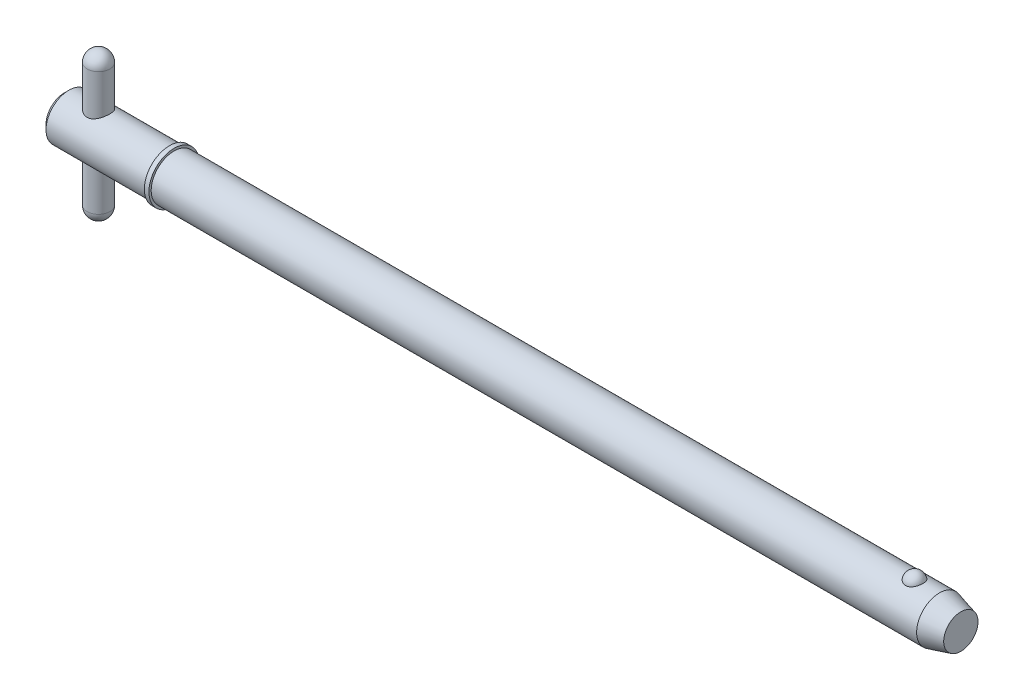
ISO-10303-21;
HEADER;
FILE_DESCRIPTION(('STEP AP214'),'2;1');
FILE_NAME('part.step','',(''),(''),'','','');
FILE_SCHEMA(('AUTOMOTIVE_DESIGN { 1 0 10303 214 1 1 1 1 }'));
ENDSEC;
DATA;
#1=APPLICATION_CONTEXT('core data for automotive mechanical design processes');
#2=APPLICATION_PROTOCOL_DEFINITION('international standard','automotive_design',2000,#1);
#3=PRODUCT_CONTEXT('',#1,'mechanical');
#4=PRODUCT('Part','Part','',(#3));
#5=PRODUCT_RELATED_PRODUCT_CATEGORY('part','',(#4));
#6=PRODUCT_DEFINITION_FORMATION('','',#4);
#7=PRODUCT_DEFINITION_CONTEXT('part definition',#1,'design');
#8=PRODUCT_DEFINITION('design','',#6,#7);
#9=PRODUCT_DEFINITION_SHAPE('','',#8);
#10=(LENGTH_UNIT() NAMED_UNIT(*) SI_UNIT(.MILLI.,.METRE.));
#11=(NAMED_UNIT(*) PLANE_ANGLE_UNIT() SI_UNIT($,.RADIAN.));
#12=(NAMED_UNIT(*) SI_UNIT($,.STERADIAN.) SOLID_ANGLE_UNIT());
#13=UNCERTAINTY_MEASURE_WITH_UNIT(LENGTH_MEASURE(1.E-05),#10,'distance_accuracy_value','');
#14=(GEOMETRIC_REPRESENTATION_CONTEXT(3) GLOBAL_UNCERTAINTY_ASSIGNED_CONTEXT((#13)) GLOBAL_UNIT_ASSIGNED_CONTEXT((#10,
#11,#12)) REPRESENTATION_CONTEXT('',''));
#15=CARTESIAN_POINT('',(0.,0.,0.));
#16=DIRECTION('',(0.,0.,1.));
#17=DIRECTION('',(1.,0.,0.));
#18=AXIS2_PLACEMENT_3D('',#15,#16,#17);
#19=CARTESIAN_POINT('',(5.94,12.7,0.));
#20=DIRECTION('',(0.,-1.,0.));
#21=DIRECTION('',(0.,0.,-1.));
#22=AXIS2_PLACEMENT_3D('',#19,#20,#21);
#23=CYLINDRICAL_SURFACE('',#22,1.98);
#24=CARTESIAN_POINT('',(5.94,-10.72,0.));
#25=DIRECTION('',(0.,-1.,0.));
#26=DIRECTION('',(0.,0.,-1.));
#27=AXIS2_PLACEMENT_3D('',#24,#25,#26);
#28=CIRCLE('',#27,1.98);
#29=CARTESIAN_POINT('',(5.94,-10.72,-1.98));
#30=VERTEX_POINT('',#29);
#31=EDGE_CURVE('P0_E10',#30,#30,#28,.F.);
#32=ORIENTED_EDGE('',*,*,#31,.T.);
#33=EDGE_LOOP('',(#32));
#34=FACE_BOUND('',#33,.T.);
#35=CARTESIAN_POINT('',(5.94,10.72,0.));
#36=DIRECTION('',(0.,-1.,0.));
#37=DIRECTION('',(0.,0.,-1.));
#38=AXIS2_PLACEMENT_3D('',#35,#36,#37);
#39=CIRCLE('',#38,1.98);
#40=CARTESIAN_POINT('',(5.94,10.72,-1.98));
#41=VERTEX_POINT('',#40);
#42=EDGE_CURVE('P0_E21',#41,#41,#39,.T.);
#43=ORIENTED_EDGE('',*,*,#42,.T.);
#44=EDGE_LOOP('',(#43));
#45=FACE_BOUND('',#44,.T.);
#46=ADVANCED_FACE('P0_F14',(#34,#45),#23,.T.);
#47=CARTESIAN_POINT('',(5.94,-10.72,0.));
#48=DIRECTION('',(0.,0.,1.));
#49=DIRECTION('',(1.,0.,0.));
#50=AXIS2_PLACEMENT_3D('',#47,#48,#49);
#51=SPHERICAL_SURFACE('',#50,1.98);
#52=CARTESIAN_POINT('',(5.94,-10.72,0.));
#53=DIRECTION('',(0.,-1.,0.));
#54=DIRECTION('',(0.,0.,-1.));
#55=AXIS2_PLACEMENT_3D('',#52,#53,#54);
#56=SPHERICAL_SURFACE('',#55,1.98);
#57=ORIENTED_EDGE('',*,*,#31,.F.);
#58=EDGE_LOOP('',(#57));
#59=FACE_BOUND('',#58,.T.);
#60=ADVANCED_FACE('P0_F29',(#59),#56,.T.);
#61=CARTESIAN_POINT('',(5.94,10.72,0.));
#62=DIRECTION('',(0.,0.,1.));
#63=DIRECTION('',(1.,0.,0.));
#64=AXIS2_PLACEMENT_3D('',#61,#62,#63);
#65=SPHERICAL_SURFACE('',#64,1.98);
#66=CARTESIAN_POINT('',(5.94,10.72,0.));
#67=DIRECTION('',(0.,-1.,0.));
#68=DIRECTION('',(0.,0.,-1.));
#69=AXIS2_PLACEMENT_3D('',#66,#67,#68);
#70=SPHERICAL_SURFACE('',#69,1.98);
#71=ORIENTED_EDGE('',*,*,#42,.F.);
#72=EDGE_LOOP('',(#71));
#73=FACE_BOUND('',#72,.T.);
#74=ADVANCED_FACE('P0_F16',(#73),#70,.T.);
#75=CLOSED_SHELL('',(#46,#60,#74));
#76=MANIFOLD_SOLID_BREP('P0_B1',#75);
#77=CARTESIAN_POINT('',(0.,0.,0.));
#78=DIRECTION('',(1.,0.,0.));
#79=DIRECTION('',(0.,0.,-1.));
#80=AXIS2_PLACEMENT_3D('',#77,#78,#79);
#81=CYLINDRICAL_SURFACE('',#80,3.97);
#82=CARTESIAN_POINT('',(151.875939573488,0.,0.));
#83=DIRECTION('',(1.,0.,0.));
#84=DIRECTION('',(0.,0.,-1.));
#85=AXIS2_PLACEMENT_3D('',#82,#83,#84);
#86=CIRCLE('',#85,3.97);
#87=CARTESIAN_POINT('',(151.875939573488,0.,-3.97));
#88=VERTEX_POINT('',#87);
#89=EDGE_CURVE('P1_E81',#88,#88,#86,.T.);
#90=ORIENTED_EDGE('',*,*,#89,.F.);
#91=EDGE_LOOP('',(#90));
#92=FACE_BOUND('',#91,.T.);
#93=CARTESIAN_POINT('',(19.05,0.,0.));
#94=DIRECTION('',(1.,0.,0.));
#95=DIRECTION('',(0.,0.,-1.));
#96=AXIS2_PLACEMENT_3D('',#93,#94,#95);
#97=CIRCLE('',#96,3.97);
#98=CARTESIAN_POINT('',(19.05,0.,-3.97));
#99=VERTEX_POINT('',#98);
#100=EDGE_CURVE('P1_E85',#99,#99,#97,.T.);
#101=ORIENTED_EDGE('',*,*,#100,.T.);
#102=EDGE_LOOP('',(#101));
#103=FACE_BOUND('',#102,.T.);
#104=CARTESIAN_POINT('',(147.545192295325,3.65715365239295,1.54470941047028));
#105=CARTESIAN_POINT('',(147.465244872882,3.65716001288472,1.54470290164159));
#106=CARTESIAN_POINT('',(147.385165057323,3.65987074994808,1.53832549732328));
#107=CARTESIAN_POINT('',(147.227237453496,3.67042218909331,1.51297018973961));
#108=CARTESIAN_POINT('',(147.14939614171,3.67827646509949,1.49395894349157));
#109=CARTESIAN_POINT('',(146.998461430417,3.69818848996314,1.44395950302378));
#110=CARTESIAN_POINT('',(146.925356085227,3.71023513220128,1.41300293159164));
#111=CARTESIAN_POINT('',(146.785563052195,3.73721833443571,1.34000212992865));
#112=CARTESIAN_POINT('',(146.718872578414,3.75215363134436,1.2979627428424));
#113=CARTESIAN_POINT('',(146.59148864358,3.78384968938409,1.20248834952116));
#114=CARTESIAN_POINT('',(146.531029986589,3.80065129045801,1.14875388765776));
#115=CARTESIAN_POINT('',(146.419694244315,3.83398532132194,1.03205417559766));
#116=CARTESIAN_POINT('',(146.368820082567,3.85051766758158,0.96908611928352));
#117=CARTESIAN_POINT('',(146.275632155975,3.88238608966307,0.832526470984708));
#118=CARTESIAN_POINT('',(146.233796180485,3.89763698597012,0.758588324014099));
#119=CARTESIAN_POINT('',(146.162510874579,3.92451063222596,0.604352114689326));
#120=CARTESIAN_POINT('',(146.133062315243,3.93613315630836,0.52405365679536));
#121=CARTESIAN_POINT('',(146.086892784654,3.95467606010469,0.358403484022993));
#122=CARTESIAN_POINT('',(146.070312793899,3.96154426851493,0.273006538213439));
#123=CARTESIAN_POINT('',(146.050756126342,3.96967008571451,0.100408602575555));
#124=CARTESIAN_POINT('',(146.047778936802,3.97092790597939,0.0132076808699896));
#125=CARTESIAN_POINT('',(146.055458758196,3.96771794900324,-0.159844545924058));
#126=CARTESIAN_POINT('',(146.066016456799,3.96329187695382,-0.245701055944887));
#127=CARTESIAN_POINT('',(146.10038009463,3.94923163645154,-0.414277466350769));
#128=CARTESIAN_POINT('',(146.124186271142,3.93959737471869,-0.496997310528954));
#129=CARTESIAN_POINT('',(146.18461142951,3.91607752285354,-0.65711357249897));
#130=CARTESIAN_POINT('',(146.221249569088,3.90218558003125,-0.734501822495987));
#131=CARTESIAN_POINT('',(146.306593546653,3.87158287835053,-0.881704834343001));
#132=CARTESIAN_POINT('',(146.355300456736,3.85487186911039,-0.951518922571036));
#133=CARTESIAN_POINT('',(146.464116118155,3.82028735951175,-1.08208159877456));
#134=CARTESIAN_POINT('',(146.524295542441,3.80240713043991,-1.14276958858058));
#135=CARTESIAN_POINT('',(146.654493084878,3.76758161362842,-1.25282437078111));
#136=CARTESIAN_POINT('',(146.724510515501,3.75063626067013,-1.30219195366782));
#137=CARTESIAN_POINT('',(146.87118160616,3.71998948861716,-1.38729709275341));
#138=CARTESIAN_POINT('',(146.947681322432,3.70623183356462,-1.42327904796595));
#139=CARTESIAN_POINT('',(147.106298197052,3.68323188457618,-1.48178996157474));
#140=CARTESIAN_POINT('',(147.1884132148,3.67398788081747,-1.50432401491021));
#141=CARTESIAN_POINT('',(147.351481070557,3.6615216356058,-1.53440939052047));
#142=CARTESIAN_POINT('',(147.432284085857,3.65801951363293,-1.54265826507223));
#143=CARTESIAN_POINT('',(147.59420850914,3.65657341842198,-1.54608423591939));
#144=CARTESIAN_POINT('',(147.675329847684,3.65862829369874,-1.54126404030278));
#145=CARTESIAN_POINT('',(147.832812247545,3.66788969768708,-1.51908474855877));
#146=CARTESIAN_POINT('',(147.909242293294,3.67492621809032,-1.50213925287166));
#147=CARTESIAN_POINT('',(148.058041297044,3.6931840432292,-1.45666982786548));
#148=CARTESIAN_POINT('',(148.130409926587,3.70440568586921,-1.42814496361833));
#149=CARTESIAN_POINT('',(148.270802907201,3.73012749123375,-1.3595631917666));
#150=CARTESIAN_POINT('',(148.338700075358,3.74469307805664,-1.31927107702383));
#151=CARTESIAN_POINT('',(148.466864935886,3.77545272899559,-1.22847440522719));
#152=CARTESIAN_POINT('',(148.527130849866,3.79164717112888,-1.17796747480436));
#153=CARTESIAN_POINT('',(148.641634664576,3.82490325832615,-1.06519260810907));
#154=CARTESIAN_POINT('',(148.695413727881,3.84196735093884,-1.00245914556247));
#155=CARTESIAN_POINT('',(148.792098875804,3.87439863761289,-0.868715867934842));
#156=CARTESIAN_POINT('',(148.835003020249,3.88976552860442,-0.797704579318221));
#157=CARTESIAN_POINT('',(148.910266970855,3.91771381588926,-0.646896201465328));
#158=CARTESIAN_POINT('',(148.94225322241,3.93019255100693,-0.566893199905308));
#159=CARTESIAN_POINT('',(148.993110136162,3.95043886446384,-0.402255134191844));
#160=CARTESIAN_POINT('',(149.011980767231,3.95820643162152,-0.317620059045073));
#161=CARTESIAN_POINT('',(149.03621625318,3.96823733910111,-0.14615699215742));
#162=CARTESIAN_POINT('',(149.041587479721,3.970503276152,-0.0593300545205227));
#163=CARTESIAN_POINT('',(149.038730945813,3.96930811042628,0.11405797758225));
#164=CARTESIAN_POINT('',(149.030503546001,3.9658471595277,0.200619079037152));
#165=CARTESIAN_POINT('',(149.000706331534,3.95358562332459,0.37050665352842));
#166=CARTESIAN_POINT('',(148.97921294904,3.94481563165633,0.453848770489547));
#167=CARTESIAN_POINT('',(148.92338397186,3.92284586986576,0.615497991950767));
#168=CARTESIAN_POINT('',(148.889047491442,3.90964579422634,0.693804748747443));
#169=CARTESIAN_POINT('',(148.807970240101,3.88006987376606,0.843703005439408));
#170=CARTESIAN_POINT('',(148.761153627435,3.86367478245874,0.915249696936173));
#171=CARTESIAN_POINT('',(148.656189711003,3.82949741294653,1.04910810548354));
#172=CARTESIAN_POINT('',(148.598042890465,3.81171519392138,1.11142021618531));
#173=CARTESIAN_POINT('',(148.471743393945,3.7767336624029,1.22503948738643));
#174=CARTESIAN_POINT('',(148.403597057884,3.75953398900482,1.27635357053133));
#175=CARTESIAN_POINT('',(148.258900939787,3.72770506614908,1.36653336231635));
#176=CARTESIAN_POINT('',(148.182348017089,3.7130767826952,1.4053943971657));
#177=CARTESIAN_POINT('',(148.025759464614,3.68864287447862,1.46830480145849));
#178=CARTESIAN_POINT('',(147.945930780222,3.67869017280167,1.49281289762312));
#179=CARTESIAN_POINT('',(147.782987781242,3.66414535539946,1.52817474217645));
#180=CARTESIAN_POINT('',(147.699884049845,3.65953723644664,1.53906926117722));
#181=CARTESIAN_POINT('',(147.592776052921,3.6573894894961,1.54414878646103));
#182=CARTESIAN_POINT('',(147.568990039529,3.65715175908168,1.54471134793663));
#183=CARTESIAN_POINT('',(147.545192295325,3.65715365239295,1.54470941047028));
#184=B_SPLINE_CURVE_WITH_KNOTS('',3,(#104,#105,#106,#107,#108,#109,#110,#111,#112,#113,#114,
#115,#116,#117,#118,#119,#120,#121,#122,#123,#124,#125,#126,#127,#128,#129,#130,#131,#132,#133,
#134,#135,#136,#137,#138,#139,#140,#141,#142,#143,#144,#145,#146,#147,#148,#149,#150,#151,#152,
#153,#154,#155,#156,#157,#158,#159,#160,#161,#162,#163,#164,#165,#166,#167,#168,#169,#170,#171,
#172,#173,#174,#175,#176,#177,#178,#179,#180,#181,#182,#183),.UNSPECIFIED.,.T.,.F.,(4,2,2,2,2,2,
2,2,2,2,2,2,2,2,2,2,2,2,2,2,2,2,2,2,2,2,2,2,2,2,2,2,2,2,2,2,2,2,2,4),(0.,0.239777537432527,
0.48019041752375,0.719971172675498,0.959647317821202,1.20639040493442,1.45320863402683,
1.71093679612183,1.96868099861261,2.22921052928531,2.48973023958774,2.74834928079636,
3.00697295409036,3.26598440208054,3.52501886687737,3.78570385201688,4.04637062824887,
4.30201257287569,4.55755760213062,4.80022994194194,5.04285200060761,5.27757006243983,
5.5123070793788,5.75210128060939,5.99195126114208,6.24392810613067,6.49594987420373,
6.75588818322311,7.01582710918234,7.2756433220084,7.53545264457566,7.79377886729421,
8.05212290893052,8.31207418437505,8.57201437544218,8.83179046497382,9.09166393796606,
9.34270057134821,9.59298357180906,9.66435753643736),.UNSPECIFIED.);
#185=CARTESIAN_POINT('',(147.545192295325,3.65715365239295,1.54470941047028));
#186=VERTEX_POINT('',#185);
#187=EDGE_CURVE('P1_E35',#186,#186,#184,.T.);
#188=ORIENTED_EDGE('',*,*,#187,.T.);
#189=EDGE_LOOP('',(#188));
#190=FACE_BOUND('',#189,.T.);
#191=ADVANCED_FACE('P1_F13',(#92,#103,#190),#81,.T.);
#192=CARTESIAN_POINT('',(0.,0.,0.));
#193=DIRECTION('',(-1.,0.,0.));
#194=DIRECTION('',(0.,0.,1.));
#195=AXIS2_PLACEMENT_3D('',#192,#193,#194);
#196=PLANE('',#195);
#197=CARTESIAN_POINT('',(0.,0.,0.));
#198=DIRECTION('',(1.,0.,0.));
#199=DIRECTION('',(0.,0.,-1.));
#200=AXIS2_PLACEMENT_3D('',#197,#198,#199);
#201=CIRCLE('',#200,3.176);
#202=CARTESIAN_POINT('',(0.,0.,-3.176));
#203=VERTEX_POINT('',#202);
#204=EDGE_CURVE('P1_E9',#203,#203,#201,.T.);
#205=ORIENTED_EDGE('',*,*,#204,.F.);
#206=EDGE_LOOP('',(#205));
#207=FACE_BOUND('',#206,.T.);
#208=ADVANCED_FACE('P1_F15',(#207),#196,.T.);
#209=CARTESIAN_POINT('',(0.793999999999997,0.,0.));
#210=DIRECTION('',(1.,0.,0.));
#211=DIRECTION('',(0.,0.,-1.));
#212=AXIS2_PLACEMENT_3D('',#209,#210,#211);
#213=CONICAL_SURFACE('',#212,3.97,0.78539816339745);
#214=ORIENTED_EDGE('',*,*,#204,.T.);
#215=EDGE_LOOP('',(#214));
#216=FACE_BOUND('',#215,.T.);
#217=CARTESIAN_POINT('',(0.793999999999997,0.,0.));
#218=DIRECTION('',(1.,0.,0.));
#219=DIRECTION('',(0.,0.,-1.));
#220=AXIS2_PLACEMENT_3D('',#217,#218,#219);
#221=CIRCLE('',#220,3.97);
#222=CARTESIAN_POINT('',(0.793999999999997,0.,-3.97));
#223=VERTEX_POINT('',#222);
#224=EDGE_CURVE('P1_E26',#223,#223,#221,.T.);
#225=ORIENTED_EDGE('',*,*,#224,.F.);
#226=EDGE_LOOP('',(#225));
#227=FACE_BOUND('',#226,.T.);
#228=ADVANCED_FACE('P1_F77',(#216,#227),#213,.T.);
#229=CARTESIAN_POINT('',(0.,0.,0.));
#230=DIRECTION('',(1.,0.,0.));
#231=DIRECTION('',(0.,0.,-1.));
#232=AXIS2_PLACEMENT_3D('',#229,#230,#231);
#233=CYLINDRICAL_SURFACE('',#232,3.97);
#234=CARTESIAN_POINT('',(5.94,-3.44100276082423,1.98));
#235=CARTESIAN_POINT('',(5.8367885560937,-3.44101282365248,1.97999171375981));
#236=CARTESIAN_POINT('',(5.73344176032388,-3.44571749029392,1.97187534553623));
#237=CARTESIAN_POINT('',(5.52991905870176,-3.46385873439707,1.93981946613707));
#238=CARTESIAN_POINT('',(5.42975031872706,-3.47731375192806,1.91584653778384));
#239=CARTESIAN_POINT('',(5.23590869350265,-3.51100678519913,1.85336773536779));
#240=CARTESIAN_POINT('',(5.14220446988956,-3.53120882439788,1.81493880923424));
#241=CARTESIAN_POINT('',(4.9625969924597,-3.57606420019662,1.72487335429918));
#242=CARTESIAN_POINT('',(4.87669412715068,-3.6007177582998,1.67323616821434));
#243=CARTESIAN_POINT('',(4.70734412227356,-3.65417020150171,1.55325205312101));
#244=CARTESIAN_POINT('',(4.62467662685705,-3.68314323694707,1.4838818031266));
#245=CARTESIAN_POINT('',(4.47154355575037,-3.74056406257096,1.33252902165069));
#246=CARTESIAN_POINT('',(4.40108404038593,-3.76901158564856,1.25054026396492));
#247=CARTESIAN_POINT('',(4.26974803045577,-3.82445556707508,1.06956584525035));
#248=CARTESIAN_POINT('',(4.20982960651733,-3.8512271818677,0.969809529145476));
#249=CARTESIAN_POINT('',(4.10798077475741,-3.89804342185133,0.760047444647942));
#250=CARTESIAN_POINT('',(4.06603907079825,-3.91809226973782,0.650048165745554));
#251=CARTESIAN_POINT('',(4.00441878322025,-3.94794912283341,0.431181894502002));
#252=CARTESIAN_POINT('',(3.98337329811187,-3.95838209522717,0.322786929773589));
#253=CARTESIAN_POINT('',(3.9596425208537,-3.97016407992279,0.103541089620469));
#254=CARTESIAN_POINT('',(3.95694618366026,-3.97151855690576,-0.00730826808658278));
#255=CARTESIAN_POINT('',(3.9694599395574,-3.96528826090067,-0.218044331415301));
#256=CARTESIAN_POINT('',(3.98314071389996,-3.95846689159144,-0.318049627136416));
#257=CARTESIAN_POINT('',(4.02528522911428,-3.93780347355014,-0.514124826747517));
#258=CARTESIAN_POINT('',(4.05375007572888,-3.92396089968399,-0.61019443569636));
#259=CARTESIAN_POINT('',(4.12484256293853,-3.89028355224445,-0.797351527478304));
#260=CARTESIAN_POINT('',(4.16766142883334,-3.87036821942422,-0.888351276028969));
#261=CARTESIAN_POINT('',(4.26598377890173,-3.82634285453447,-1.06209448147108));
#262=CARTESIAN_POINT('',(4.32149181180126,-3.8022313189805,-1.14483496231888));
#263=CARTESIAN_POINT('',(4.44962332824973,-3.74940011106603,-1.30802500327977));
#264=CARTESIAN_POINT('',(4.52336636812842,-3.72046031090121,-1.38752498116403));
#265=CARTESIAN_POINT('',(4.68287656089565,-3.66269463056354,-1.53354043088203));
#266=CARTESIAN_POINT('',(4.7686527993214,-3.63386885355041,-1.60004599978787));
#267=CARTESIAN_POINT('',(4.9564069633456,-3.57763161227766,-1.72228426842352));
#268=CARTESIAN_POINT('',(5.05906485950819,-3.5504233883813,-1.77707534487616));
#269=CARTESIAN_POINT('',(5.27381412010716,-3.50334038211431,-1.86819784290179));
#270=CARTESIAN_POINT('',(5.38589553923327,-3.48345798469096,-1.90454844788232));
#271=CARTESIAN_POINT('',(5.6069795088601,-3.45548331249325,-1.95481643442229));
#272=CARTESIAN_POINT('',(5.71552407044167,-3.44658268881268,-1.97028113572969));
#273=CARTESIAN_POINT('',(5.93399639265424,-3.43928114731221,-1.98300600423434));
#274=CARTESIAN_POINT('',(6.04392313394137,-3.44087289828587,-1.98027888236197));
#275=CARTESIAN_POINT('',(6.24931618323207,-3.45351901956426,-1.95811780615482));
#276=CARTESIAN_POINT('',(6.34505668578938,-3.46352725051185,-1.94052989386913));
#277=CARTESIAN_POINT('',(6.53204702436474,-3.49033612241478,-1.89188242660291));
#278=CARTESIAN_POINT('',(6.62329540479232,-3.50713894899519,-1.86081853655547));
#279=CARTESIAN_POINT('',(6.80352105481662,-3.54655680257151,-1.78458666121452));
#280=CARTESIAN_POINT('',(6.89219712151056,-3.56940508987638,-1.73883178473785));
#281=CARTESIAN_POINT('',(7.06112449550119,-3.61813012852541,-1.63502913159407));
#282=CARTESIAN_POINT('',(7.14137144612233,-3.6440084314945,-1.57697504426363));
#283=CARTESIAN_POINT('',(7.30168083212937,-3.69977514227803,-1.44171920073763));
#284=CARTESIAN_POINT('',(7.38046039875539,-3.7297597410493,-1.36302972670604));
#285=CARTESIAN_POINT('',(7.52409649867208,-3.78754991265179,-1.19307190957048));
#286=CARTESIAN_POINT('',(7.58894840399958,-3.81535475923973,-1.10179940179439));
#287=CARTESIAN_POINT('',(7.70430122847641,-3.86658972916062,-0.906019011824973));
#288=CARTESIAN_POINT('',(7.75438714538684,-3.88988795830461,-0.801229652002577));
#289=CARTESIAN_POINT('',(7.83572184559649,-3.92848199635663,-0.583216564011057));
#290=CARTESIAN_POINT('',(7.86698708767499,-3.94378479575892,-0.470000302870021));
#291=CARTESIAN_POINT('',(7.90711051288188,-3.96355307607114,-0.249525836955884));
#292=CARTESIAN_POINT('',(7.91775648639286,-3.96888171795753,-0.142669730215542));
#293=CARTESIAN_POINT('',(7.92160247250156,-3.97079858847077,0.0714191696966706));
#294=CARTESIAN_POINT('',(7.91480852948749,-3.96738984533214,0.178651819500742));
#295=CARTESIAN_POINT('',(7.88515479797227,-3.9527181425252,0.383072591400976));
#296=CARTESIAN_POINT('',(7.8633739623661,-3.94198303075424,0.480459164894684));
#297=CARTESIAN_POINT('',(7.80581513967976,-3.91422178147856,0.670038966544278));
#298=CARTESIAN_POINT('',(7.77003513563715,-3.89719473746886,0.762231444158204));
#299=CARTESIAN_POINT('',(7.68389191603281,-3.85747818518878,0.943248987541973));
#300=CARTESIAN_POINT('',(7.63296879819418,-3.83457704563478,1.03175978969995));
#301=CARTESIAN_POINT('',(7.51869140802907,-3.7855122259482,1.19934744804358));
#302=CARTESIAN_POINT('',(7.45533142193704,-3.75934704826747,1.2784199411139));
#303=CARTESIAN_POINT('',(7.31068939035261,-3.70329841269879,1.433144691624));
#304=CARTESIAN_POINT('',(7.22825362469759,-3.67330340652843,1.50768183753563));
#305=CARTESIAN_POINT('',(7.05162367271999,-3.61514025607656,1.64226879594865));
#306=CARTESIAN_POINT('',(6.95741928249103,-3.58697372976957,1.70230590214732));
#307=CARTESIAN_POINT('',(6.75590859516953,-3.53504049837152,1.80775364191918));
#308=CARTESIAN_POINT('',(6.64828786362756,-3.51143624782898,1.85265616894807));
#309=CARTESIAN_POINT('',(6.48137774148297,-3.48289659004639,1.90544537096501));
#310=CARTESIAN_POINT('',(6.42488151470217,-3.4745323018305,1.9206071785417));
#311=CARTESIAN_POINT('',(6.31046920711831,-3.4604244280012,1.94591259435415));
#312=CARTESIAN_POINT('',(6.25255415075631,-3.45467900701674,1.95605971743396));
#313=CARTESIAN_POINT('',(6.1521444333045,-3.44728060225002,1.96905939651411));
#314=CARTESIAN_POINT('',(6.10985721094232,-3.44493297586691,1.97315742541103));
#315=CARTESIAN_POINT('',(6.02505433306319,-3.44179192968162,1.97862952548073));
#316=CARTESIAN_POINT('',(5.98253866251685,-3.44099861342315,1.98000341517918));
#317=CARTESIAN_POINT('',(5.94,-3.44100276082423,1.98));
#318=B_SPLINE_CURVE_WITH_KNOTS('',3,(#234,#235,#236,#237,#238,#239,#240,#241,#242,#243,#244,
#245,#246,#247,#248,#249,#250,#251,#252,#253,#254,#255,#256,#257,#258,#259,#260,#261,#262,#263,
#264,#265,#266,#267,#268,#269,#270,#271,#272,#273,#274,#275,#276,#277,#278,#279,#280,#281,#282,
#283,#284,#285,#286,#287,#288,#289,#290,#291,#292,#293,#294,#295,#296,#297,#298,#299,#300,#301,
#302,#303,#304,#305,#306,#307,#308,#309,#310,#311,#312,#313,#314,#315,#316,#317),.UNSPECIFIED.,
.T.,.F.,(4,2,2,2,2,2,2,2,2,2,2,2,2,2,2,2,2,2,2,2,2,2,2,2,2,2,2,2,2,2,2,2,2,2,2,2,2,2,2,2,2,4),
(0.,0.309462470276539,0.619579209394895,0.928068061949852,1.23657226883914,1.57038619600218,
1.90436536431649,2.26071614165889,2.61684266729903,2.94773555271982,3.27842924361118,
3.58050679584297,3.88260694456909,4.18890317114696,4.49530936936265,4.83057163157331,
5.1660884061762,5.52272472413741,5.87898927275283,6.20706708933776,6.53491569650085,
6.82716910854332,7.11951660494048,7.42541184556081,7.73146442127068,8.07586334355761,
8.42037652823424,8.77380887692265,9.12693169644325,9.44775848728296,9.76847409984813,
10.0682302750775,10.3680296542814,10.6806938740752,10.9935020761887,11.3373031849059,
11.6814044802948,12.0361164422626,12.2131519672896,12.3900632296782,12.5175998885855,
12.6451450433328),.UNSPECIFIED.);
#319=CARTESIAN_POINT('',(5.94,-3.44100276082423,1.98));
#320=VERTEX_POINT('',#319);
#321=EDGE_CURVE('P1_E17',#320,#320,#318,.T.);
#322=ORIENTED_EDGE('',*,*,#321,.F.);
#323=EDGE_LOOP('',(#322));
#324=FACE_BOUND('',#323,.T.);
#325=CARTESIAN_POINT('',(5.94,3.44100276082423,1.98));
#326=CARTESIAN_POINT('',(6.0432114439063,3.44101282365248,1.97999171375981));
#327=CARTESIAN_POINT('',(6.14655823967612,3.44571749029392,1.97187534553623));
#328=CARTESIAN_POINT('',(6.35008094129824,3.46385873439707,1.93981946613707));
#329=CARTESIAN_POINT('',(6.45024968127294,3.47731375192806,1.91584653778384));
#330=CARTESIAN_POINT('',(6.64409130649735,3.51100678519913,1.85336773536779));
#331=CARTESIAN_POINT('',(6.73779553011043,3.53120882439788,1.81493880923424));
#332=CARTESIAN_POINT('',(6.91740300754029,3.57606420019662,1.72487335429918));
#333=CARTESIAN_POINT('',(7.00330587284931,3.6007177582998,1.67323616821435));
#334=CARTESIAN_POINT('',(7.17265587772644,3.65417020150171,1.55325205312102));
#335=CARTESIAN_POINT('',(7.25532337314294,3.68314323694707,1.4838818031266));
#336=CARTESIAN_POINT('',(7.40845644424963,3.74056406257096,1.3325290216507));
#337=CARTESIAN_POINT('',(7.47891595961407,3.76901158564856,1.25054026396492));
#338=CARTESIAN_POINT('',(7.61025196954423,3.82445556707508,1.06956584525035));
#339=CARTESIAN_POINT('',(7.67017039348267,3.8512271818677,0.969809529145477));
#340=CARTESIAN_POINT('',(7.77201922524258,3.89804342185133,0.760047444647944));
#341=CARTESIAN_POINT('',(7.81396092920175,3.91809226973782,0.650048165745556));
#342=CARTESIAN_POINT('',(7.87558121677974,3.94794912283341,0.431181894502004));
#343=CARTESIAN_POINT('',(7.89662670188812,3.95838209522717,0.322786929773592));
#344=CARTESIAN_POINT('',(7.9203574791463,3.97016407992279,0.103541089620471));
#345=CARTESIAN_POINT('',(7.92305381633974,3.97151855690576,-0.00730826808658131));
#346=CARTESIAN_POINT('',(7.9105400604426,3.96528826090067,-0.2180443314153));
#347=CARTESIAN_POINT('',(7.89685928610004,3.95846689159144,-0.318049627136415));
#348=CARTESIAN_POINT('',(7.85471477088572,3.93780347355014,-0.514124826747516));
#349=CARTESIAN_POINT('',(7.82624992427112,3.92396089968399,-0.61019443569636));
#350=CARTESIAN_POINT('',(7.75515743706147,3.89028355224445,-0.797351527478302));
#351=CARTESIAN_POINT('',(7.71233857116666,3.87036821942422,-0.888351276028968));
#352=CARTESIAN_POINT('',(7.61401622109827,3.82634285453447,-1.06209448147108));
#353=CARTESIAN_POINT('',(7.55850818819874,3.8022313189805,-1.14483496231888));
#354=CARTESIAN_POINT('',(7.43037667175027,3.74940011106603,-1.30802500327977));
#355=CARTESIAN_POINT('',(7.35663363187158,3.72046031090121,-1.38752498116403));
#356=CARTESIAN_POINT('',(7.19712343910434,3.66269463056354,-1.53354043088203));
#357=CARTESIAN_POINT('',(7.1113472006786,3.63386885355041,-1.60004599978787));
#358=CARTESIAN_POINT('',(6.9235930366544,3.57763161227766,-1.72228426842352));
#359=CARTESIAN_POINT('',(6.82093514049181,3.5504233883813,-1.77707534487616));
#360=CARTESIAN_POINT('',(6.60618587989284,3.50334038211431,-1.86819784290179));
#361=CARTESIAN_POINT('',(6.49410446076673,3.48345798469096,-1.90454844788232));
#362=CARTESIAN_POINT('',(6.2730204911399,3.45548331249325,-1.95481643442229));
#363=CARTESIAN_POINT('',(6.16447592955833,3.44658268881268,-1.97028113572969));
#364=CARTESIAN_POINT('',(5.94600360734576,3.43928114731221,-1.98300600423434));
#365=CARTESIAN_POINT('',(5.83607686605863,3.44087289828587,-1.98027888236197));
#366=CARTESIAN_POINT('',(5.63068381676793,3.45351901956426,-1.95811780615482));
#367=CARTESIAN_POINT('',(5.53494331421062,3.46352725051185,-1.94052989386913));
#368=CARTESIAN_POINT('',(5.34795297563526,3.49033612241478,-1.89188242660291));
#369=CARTESIAN_POINT('',(5.25670459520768,3.50713894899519,-1.86081853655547));
#370=CARTESIAN_POINT('',(5.07647894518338,3.54655680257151,-1.78458666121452));
#371=CARTESIAN_POINT('',(4.98780287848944,3.56940508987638,-1.73883178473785));
#372=CARTESIAN_POINT('',(4.81887550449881,3.61813012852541,-1.63502913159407));
#373=CARTESIAN_POINT('',(4.73862855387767,3.6440084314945,-1.57697504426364));
#374=CARTESIAN_POINT('',(4.57831916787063,3.69977514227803,-1.44171920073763));
#375=CARTESIAN_POINT('',(4.49953960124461,3.7297597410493,-1.36302972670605));
#376=CARTESIAN_POINT('',(4.35590350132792,3.78754991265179,-1.19307190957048));
#377=CARTESIAN_POINT('',(4.29105159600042,3.81535475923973,-1.10179940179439));
#378=CARTESIAN_POINT('',(4.17569877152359,3.86658972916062,-0.906019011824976));
#379=CARTESIAN_POINT('',(4.12561285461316,3.88988795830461,-0.80122965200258));
#380=CARTESIAN_POINT('',(4.04427815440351,3.92848199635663,-0.58321656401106));
#381=CARTESIAN_POINT('',(4.01301291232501,3.94378479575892,-0.470000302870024));
#382=CARTESIAN_POINT('',(3.97288948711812,3.96355307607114,-0.249525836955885));
#383=CARTESIAN_POINT('',(3.96224351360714,3.96888171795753,-0.142669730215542));
#384=CARTESIAN_POINT('',(3.95839752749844,3.97079858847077,0.0714191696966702));
#385=CARTESIAN_POINT('',(3.96519147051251,3.96738984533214,0.178651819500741));
#386=CARTESIAN_POINT('',(3.99484520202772,3.9527181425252,0.383072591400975));
#387=CARTESIAN_POINT('',(4.01662603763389,3.94198303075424,0.480459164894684));
#388=CARTESIAN_POINT('',(4.07418486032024,3.91422178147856,0.670038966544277));
#389=CARTESIAN_POINT('',(4.10996486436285,3.89719473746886,0.762231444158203));
#390=CARTESIAN_POINT('',(4.19610808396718,3.85747818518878,0.943248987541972));
#391=CARTESIAN_POINT('',(4.24703120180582,3.83457704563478,1.03175978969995));
#392=CARTESIAN_POINT('',(4.36130859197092,3.7855122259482,1.19934744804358));
#393=CARTESIAN_POINT('',(4.42466857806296,3.75934704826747,1.2784199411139));
#394=CARTESIAN_POINT('',(4.56931060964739,3.70329841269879,1.433144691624));
#395=CARTESIAN_POINT('',(4.65174637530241,3.67330340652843,1.50768183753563));
#396=CARTESIAN_POINT('',(4.82837632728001,3.61514025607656,1.64226879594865));
#397=CARTESIAN_POINT('',(4.92258071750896,3.58697372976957,1.70230590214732));
#398=CARTESIAN_POINT('',(5.12409140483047,3.53504049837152,1.80775364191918));
#399=CARTESIAN_POINT('',(5.23171213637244,3.51143624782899,1.85265616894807));
#400=CARTESIAN_POINT('',(5.39862225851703,3.48289659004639,1.90544537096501));
#401=CARTESIAN_POINT('',(5.45511848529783,3.4745323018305,1.9206071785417));
#402=CARTESIAN_POINT('',(5.56953079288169,3.4604244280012,1.94591259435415));
#403=CARTESIAN_POINT('',(5.62744584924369,3.45467900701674,1.95605971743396));
#404=CARTESIAN_POINT('',(5.7278555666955,3.44728060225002,1.9690593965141));
#405=CARTESIAN_POINT('',(5.77014278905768,3.44493297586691,1.97315742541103));
#406=CARTESIAN_POINT('',(5.85494566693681,3.44179192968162,1.97862952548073));
#407=CARTESIAN_POINT('',(5.89746133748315,3.44099861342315,1.98000341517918));
#408=CARTESIAN_POINT('',(5.94,3.44100276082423,1.98));
#409=B_SPLINE_CURVE_WITH_KNOTS('',3,(#325,#326,#327,#328,#329,#330,#331,#332,#333,#334,#335,
#336,#337,#338,#339,#340,#341,#342,#343,#344,#345,#346,#347,#348,#349,#350,#351,#352,#353,#354,
#355,#356,#357,#358,#359,#360,#361,#362,#363,#364,#365,#366,#367,#368,#369,#370,#371,#372,#373,
#374,#375,#376,#377,#378,#379,#380,#381,#382,#383,#384,#385,#386,#387,#388,#389,#390,#391,#392,
#393,#394,#395,#396,#397,#398,#399,#400,#401,#402,#403,#404,#405,#406,#407,#408),.UNSPECIFIED.,
.T.,.F.,(4,2,2,2,2,2,2,2,2,2,2,2,2,2,2,2,2,2,2,2,2,2,2,2,2,2,2,2,2,2,2,2,2,2,2,2,2,2,2,2,2,4),
(0.,0.309462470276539,0.619579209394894,0.928068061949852,1.23657226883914,1.57038619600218,
1.90436536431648,2.26071614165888,2.61684266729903,2.94773555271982,3.27842924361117,
3.58050679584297,3.88260694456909,4.18890317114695,4.49530936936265,4.83057163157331,
5.1660884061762,5.5227247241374,5.87898927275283,6.20706708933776,6.53491569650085,
6.82716910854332,7.11951660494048,7.42541184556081,7.73146442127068,8.07586334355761,
8.42037652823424,8.77380887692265,9.12693169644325,9.44775848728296,9.76847409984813,
10.0682302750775,10.3680296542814,10.6806938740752,10.9935020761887,11.3373031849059,
11.6814044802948,12.0361164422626,12.2131519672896,12.3900632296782,12.5175998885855,
12.6451450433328),.UNSPECIFIED.);
#410=CARTESIAN_POINT('',(5.94,3.44100276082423,1.98));
#411=VERTEX_POINT('',#410);
#412=EDGE_CURVE('P1_E43',#411,#411,#409,.T.);
#413=ORIENTED_EDGE('',*,*,#412,.F.);
#414=EDGE_LOOP('',(#413));
#415=FACE_BOUND('',#414,.T.);
#416=ORIENTED_EDGE('',*,*,#224,.T.);
#417=EDGE_LOOP('',(#416));
#418=FACE_BOUND('',#417,.T.);
#419=CARTESIAN_POINT('',(18.256,0.,0.));
#420=DIRECTION('',(1.,0.,0.));
#421=DIRECTION('',(0.,0.,-1.));
#422=AXIS2_PLACEMENT_3D('',#419,#420,#421);
#423=CIRCLE('',#422,3.97);
#424=CARTESIAN_POINT('',(18.256,0.,-3.97));
#425=VERTEX_POINT('',#424);
#426=EDGE_CURVE('P1_E31',#425,#425,#423,.T.);
#427=ORIENTED_EDGE('',*,*,#426,.F.);
#428=EDGE_LOOP('',(#427));
#429=FACE_BOUND('',#428,.T.);
#430=ADVANCED_FACE('P1_F103',(#324,#415,#418,#429),#233,.T.);
#431=CARTESIAN_POINT('',(18.256,3.97,0.));
#432=DIRECTION('',(-1.,0.,0.));
#433=DIRECTION('',(0.,0.,1.));
#434=AXIS2_PLACEMENT_3D('',#431,#432,#433);
#435=PLANE('',#434);
#436=ORIENTED_EDGE('',*,*,#426,.T.);
#437=EDGE_LOOP('',(#436));
#438=FACE_BOUND('',#437,.T.);
#439=CARTESIAN_POINT('',(18.256,0.,0.));
#440=DIRECTION('',(1.,0.,0.));
#441=DIRECTION('',(0.,0.,-1.));
#442=AXIS2_PLACEMENT_3D('',#439,#440,#441);
#443=CIRCLE('',#442,4.367);
#444=CARTESIAN_POINT('',(18.256,0.,-4.367));
#445=VERTEX_POINT('',#444);
#446=EDGE_CURVE('P1_E91',#445,#445,#443,.T.);
#447=ORIENTED_EDGE('',*,*,#446,.F.);
#448=EDGE_LOOP('',(#447));
#449=FACE_BOUND('',#448,.T.);
#450=ADVANCED_FACE('P1_F100',(#438,#449),#435,.T.);
#451=CARTESIAN_POINT('',(0.,0.,0.));
#452=DIRECTION('',(1.,0.,0.));
#453=DIRECTION('',(0.,0.,-1.));
#454=AXIS2_PLACEMENT_3D('',#451,#452,#453);
#455=CYLINDRICAL_SURFACE('',#454,4.367);
#456=ORIENTED_EDGE('',*,*,#446,.T.);
#457=EDGE_LOOP('',(#456));
#458=FACE_BOUND('',#457,.T.);
#459=CARTESIAN_POINT('',(19.05,0.,0.));
#460=DIRECTION('',(1.,0.,0.));
#461=DIRECTION('',(0.,0.,-1.));
#462=AXIS2_PLACEMENT_3D('',#459,#460,#461);
#463=CIRCLE('',#462,4.367);
#464=CARTESIAN_POINT('',(19.05,0.,-4.367));
#465=VERTEX_POINT('',#464);
#466=EDGE_CURVE('P1_E88',#465,#465,#463,.T.);
#467=ORIENTED_EDGE('',*,*,#466,.F.);
#468=EDGE_LOOP('',(#467));
#469=FACE_BOUND('',#468,.T.);
#470=ADVANCED_FACE('P1_F68',(#458,#469),#455,.T.);
#471=CARTESIAN_POINT('',(19.05,4.367,0.));
#472=DIRECTION('',(1.,0.,0.));
#473=DIRECTION('',(0.,0.,-1.));
#474=AXIS2_PLACEMENT_3D('',#471,#472,#473);
#475=PLANE('',#474);
#476=ORIENTED_EDGE('',*,*,#466,.T.);
#477=EDGE_LOOP('',(#476));
#478=FACE_BOUND('',#477,.T.);
#479=ORIENTED_EDGE('',*,*,#100,.F.);
#480=EDGE_LOOP('',(#479));
#481=FACE_BOUND('',#480,.T.);
#482=ADVANCED_FACE('P1_F62',(#478,#481),#475,.T.);
#483=CARTESIAN_POINT('',(155.58,0.,0.));
#484=DIRECTION('',(-1.,0.,0.));
#485=DIRECTION('',(0.,0.,1.));
#486=AXIS2_PLACEMENT_3D('',#483,#484,#485);
#487=CONICAL_SURFACE('',#486,2.97750000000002,0.26179938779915);
#488=ORIENTED_EDGE('',*,*,#89,.T.);
#489=EDGE_LOOP('',(#488));
#490=FACE_BOUND('',#489,.T.);
#491=CARTESIAN_POINT('',(155.58,0.,0.));
#492=DIRECTION('',(1.,0.,0.));
#493=DIRECTION('',(0.,0.,-1.));
#494=AXIS2_PLACEMENT_3D('',#491,#492,#493);
#495=CIRCLE('',#494,2.97750000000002);
#496=CARTESIAN_POINT('',(155.58,0.,-2.97750000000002));
#497=VERTEX_POINT('',#496);
#498=EDGE_CURVE('P1_E42',#497,#497,#495,.T.);
#499=ORIENTED_EDGE('',*,*,#498,.F.);
#500=EDGE_LOOP('',(#499));
#501=FACE_BOUND('',#500,.T.);
#502=ADVANCED_FACE('P1_F59',(#490,#501),#487,.T.);
#503=CARTESIAN_POINT('',(155.58,2.97750000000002,0.));
#504=DIRECTION('',(1.,0.,0.));
#505=DIRECTION('',(0.,0.,-1.));
#506=AXIS2_PLACEMENT_3D('',#503,#504,#505);
#507=PLANE('',#506);
#508=ORIENTED_EDGE('',*,*,#498,.T.);
#509=EDGE_LOOP('',(#508));
#510=FACE_BOUND('',#509,.T.);
#511=ADVANCED_FACE('P1_F55',(#510),#507,.T.);
#512=CARTESIAN_POINT('',(147.545192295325,3.573,0.));
#513=DIRECTION('',(-1.,0.,0.));
#514=DIRECTION('',(0.,-1.,0.));
#515=AXIS2_PLACEMENT_3D('',#512,#513,#514);
#516=SPHERICAL_SURFACE('',#515,1.54699999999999);
#517=ORIENTED_EDGE('',*,*,#187,.F.);
#518=EDGE_LOOP('',(#517));
#519=FACE_BOUND('',#518,.T.);
#520=ADVANCED_FACE('P1_F50',(#519),#516,.T.);
#521=CARTESIAN_POINT('',(5.94,-4.367,0.));
#522=DIRECTION('',(0.,1.,0.));
#523=DIRECTION('',(0.,0.,1.));
#524=AXIS2_PLACEMENT_3D('',#521,#522,#523);
#525=CYLINDRICAL_SURFACE('',#524,1.98);
#526=ORIENTED_EDGE('',*,*,#321,.T.);
#527=EDGE_LOOP('',(#526));
#528=FACE_BOUND('',#527,.T.);
#529=ORIENTED_EDGE('',*,*,#412,.T.);
#530=EDGE_LOOP('',(#529));
#531=FACE_BOUND('',#530,.T.);
#532=ADVANCED_FACE('P1_F54',(#528,#531),#525,.F.);
#533=CLOSED_SHELL('',(#191,#208,#228,#430,#450,#470,#482,#502,#511,#520,#532));
#534=MANIFOLD_SOLID_BREP('P1_B1',#533);
#535=ADVANCED_BREP_SHAPE_REPRESENTATION('',(#18,#76,#534),#14);
#536=SHAPE_DEFINITION_REPRESENTATION(#9,#535);
ENDSEC;
END-ISO-10303-21;
